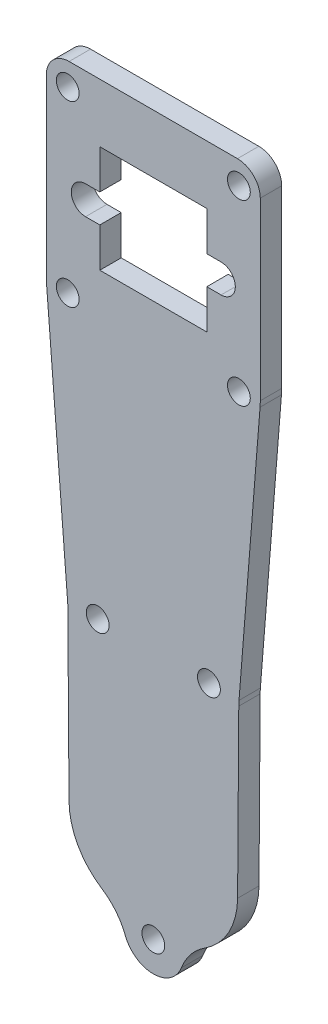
ISO-10303-21;
HEADER;
FILE_DESCRIPTION(('STEP AP214'),'2;1');
FILE_NAME('part.step','',(''),(''),'','','');
FILE_SCHEMA(('AUTOMOTIVE_DESIGN { 1 0 10303 214 1 1 1 1 }'));
ENDSEC;
DATA;
#1=APPLICATION_CONTEXT('core data for automotive mechanical design processes');
#2=APPLICATION_PROTOCOL_DEFINITION('international standard','automotive_design',2000,#1);
#3=PRODUCT_CONTEXT('',#1,'mechanical');
#4=PRODUCT('Part','Part','',(#3));
#5=PRODUCT_RELATED_PRODUCT_CATEGORY('part','',(#4));
#6=PRODUCT_DEFINITION_FORMATION('','',#4);
#7=PRODUCT_DEFINITION_CONTEXT('part definition',#1,'design');
#8=PRODUCT_DEFINITION('design','',#6,#7);
#9=PRODUCT_DEFINITION_SHAPE('','',#8);
#10=(LENGTH_UNIT() NAMED_UNIT(*) SI_UNIT(.MILLI.,.METRE.));
#11=(NAMED_UNIT(*) PLANE_ANGLE_UNIT() SI_UNIT($,.RADIAN.));
#12=(NAMED_UNIT(*) SI_UNIT($,.STERADIAN.) SOLID_ANGLE_UNIT());
#13=UNCERTAINTY_MEASURE_WITH_UNIT(LENGTH_MEASURE(1.E-05),#10,'distance_accuracy_value','');
#14=(GEOMETRIC_REPRESENTATION_CONTEXT(3) GLOBAL_UNCERTAINTY_ASSIGNED_CONTEXT((#13)) GLOBAL_UNIT_ASSIGNED_CONTEXT((#10,
#11,#12)) REPRESENTATION_CONTEXT('',''));
#15=CARTESIAN_POINT('',(0.,0.,0.));
#16=DIRECTION('',(0.,0.,1.));
#17=DIRECTION('',(1.,0.,0.));
#18=AXIS2_PLACEMENT_3D('',#15,#16,#17);
#19=CARTESIAN_POINT('',(9.49999999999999,50.,3.));
#20=DIRECTION('',(0.,0.,-1.));
#21=DIRECTION('',(-1.,0.,0.));
#22=AXIS2_PLACEMENT_3D('',#19,#20,#21);
#23=CYLINDRICAL_SURFACE('',#22,2.);
#24=DIRECTION('',(0.,0.,-1.));
#25=VECTOR('',#24,1.);
#26=CARTESIAN_POINT('',(9.49999999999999,48.,3.));
#27=LINE('',#26,#25);
#28=CARTESIAN_POINT('',(9.49999999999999,48.,3.));
#29=VERTEX_POINT('',#28);
#30=CARTESIAN_POINT('',(9.49999999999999,48.,0.));
#31=VERTEX_POINT('',#30);
#32=EDGE_CURVE('E614',#29,#31,#27,.T.);
#33=ORIENTED_EDGE('',*,*,#32,.F.);
#34=CARTESIAN_POINT('',(9.49999999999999,50.,3.));
#35=DIRECTION('',(0.,0.,1.));
#36=DIRECTION('',(1.,0.,0.));
#37=AXIS2_PLACEMENT_3D('',#34,#35,#36);
#38=CIRCLE('',#37,2.);
#39=CARTESIAN_POINT('',(9.5,52.,3.));
#40=VERTEX_POINT('',#39);
#41=EDGE_CURVE('E62',#29,#40,#38,.T.);
#42=ORIENTED_EDGE('',*,*,#41,.T.);
#43=DIRECTION('',(0.,0.,1.));
#44=VECTOR('',#43,1.);
#45=CARTESIAN_POINT('',(9.49999999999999,52.,3.));
#46=LINE('',#45,#44);
#47=CARTESIAN_POINT('',(9.5,52.,0.));
#48=VERTEX_POINT('',#47);
#49=EDGE_CURVE('E617',#48,#40,#46,.T.);
#50=ORIENTED_EDGE('',*,*,#49,.F.);
#51=CARTESIAN_POINT('',(9.49999999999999,50.,0.));
#52=DIRECTION('',(0.,0.,1.));
#53=DIRECTION('',(1.,0.,0.));
#54=AXIS2_PLACEMENT_3D('',#51,#52,#53);
#55=CIRCLE('',#54,2.);
#56=EDGE_CURVE('E11',#48,#31,#55,.F.);
#57=ORIENTED_EDGE('',*,*,#56,.T.);
#58=EDGE_LOOP('',(#33,#42,#50,#57));
#59=FACE_BOUND('',#58,.T.);
#60=ADVANCED_FACE('F53',(#59),#23,.F.);
#61=CARTESIAN_POINT('',(-9.5,50.,0.));
#62=DIRECTION('',(0.,0.,-1.));
#63=DIRECTION('',(-1.,0.,0.));
#64=AXIS2_PLACEMENT_3D('',#61,#62,#63);
#65=CYLINDRICAL_SURFACE('',#64,2.);
#66=DIRECTION('',(0.,0.,-1.));
#67=VECTOR('',#66,1.);
#68=CARTESIAN_POINT('',(-9.5,48.,3.));
#69=LINE('',#68,#67);
#70=CARTESIAN_POINT('',(-9.5,48.,0.));
#71=VERTEX_POINT('',#70);
#72=CARTESIAN_POINT('',(-9.5,48.,3.));
#73=VERTEX_POINT('',#72);
#74=EDGE_CURVE('E600',#71,#73,#69,.F.);
#75=ORIENTED_EDGE('',*,*,#74,.F.);
#76=CARTESIAN_POINT('',(-9.5,50.,0.));
#77=DIRECTION('',(0.,0.,1.));
#78=DIRECTION('',(1.,0.,0.));
#79=AXIS2_PLACEMENT_3D('',#76,#77,#78);
#80=CIRCLE('',#79,2.);
#81=CARTESIAN_POINT('',(-9.5,52.,0.));
#82=VERTEX_POINT('',#81);
#83=EDGE_CURVE('E608',#71,#82,#80,.F.);
#84=ORIENTED_EDGE('',*,*,#83,.T.);
#85=DIRECTION('',(0.,0.,1.));
#86=VECTOR('',#85,1.);
#87=CARTESIAN_POINT('',(-9.5,52.,0.));
#88=LINE('',#87,#86);
#89=CARTESIAN_POINT('',(-9.5,52.,3.));
#90=VERTEX_POINT('',#89);
#91=EDGE_CURVE('E604',#90,#82,#88,.F.);
#92=ORIENTED_EDGE('',*,*,#91,.F.);
#93=CARTESIAN_POINT('',(-9.5,50.,3.));
#94=DIRECTION('',(0.,0.,1.));
#95=DIRECTION('',(1.,0.,0.));
#96=AXIS2_PLACEMENT_3D('',#93,#94,#95);
#97=CIRCLE('',#96,2.);
#98=EDGE_CURVE('E611',#90,#73,#97,.T.);
#99=ORIENTED_EDGE('',*,*,#98,.T.);
#100=EDGE_LOOP('',(#75,#84,#92,#99));
#101=FACE_BOUND('',#100,.T.);
#102=ADVANCED_FACE('F757',(#101),#65,.F.);
#103=CARTESIAN_POINT('',(-11.77,-39.5169839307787,3.));
#104=DIRECTION('',(0.,0.,-1.));
#105=DIRECTION('',(-1.,0.,0.));
#106=AXIS2_PLACEMENT_3D('',#103,#104,#105);
#107=CYLINDRICAL_SURFACE('',#106,8.40698393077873);
#108=CARTESIAN_POINT('',(-11.77,-39.5169839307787,3.));
#109=DIRECTION('',(0.,0.,1.));
#110=DIRECTION('',(1.,0.,0.));
#111=AXIS2_PLACEMENT_3D('',#108,#109,#110);
#112=CIRCLE('',#111,8.40698393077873);
#113=CARTESIAN_POINT('',(-3.92115991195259,-36.5048272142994,3.));
#114=VERTEX_POINT('',#113);
#115=CARTESIAN_POINT('',(-7.22537581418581,-32.4442355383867,3.));
#116=VERTEX_POINT('',#115);
#117=EDGE_CURVE('E320',#114,#116,#112,.T.);
#118=ORIENTED_EDGE('',*,*,#117,.T.);
#119=DIRECTION('',(0.,0.,-1.));
#120=VECTOR('',#119,1.);
#121=CARTESIAN_POINT('',(-7.22537581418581,-32.4442355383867,3.));
#122=LINE('',#121,#120);
#123=CARTESIAN_POINT('',(-7.22537581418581,-32.4442355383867,0.));
#124=VERTEX_POINT('',#123);
#125=EDGE_CURVE('E584',#116,#124,#122,.T.);
#126=ORIENTED_EDGE('',*,*,#125,.T.);
#127=CARTESIAN_POINT('',(-11.77,-39.5169839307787,0.));
#128=DIRECTION('',(0.,0.,1.));
#129=DIRECTION('',(1.,0.,0.));
#130=AXIS2_PLACEMENT_3D('',#127,#128,#129);
#131=CIRCLE('',#130,8.40698393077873);
#132=CARTESIAN_POINT('',(-3.92115991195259,-36.5048272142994,0.));
#133=VERTEX_POINT('',#132);
#134=EDGE_CURVE('E425',#133,#124,#131,.T.);
#135=ORIENTED_EDGE('',*,*,#134,.F.);
#136=DIRECTION('',(0.,0.,-1.));
#137=VECTOR('',#136,1.);
#138=CARTESIAN_POINT('',(-3.92115991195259,-36.5048272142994,3.));
#139=LINE('',#138,#137);
#140=EDGE_CURVE('E499',#114,#133,#139,.T.);
#141=ORIENTED_EDGE('',*,*,#140,.F.);
#142=EDGE_LOOP('',(#118,#126,#135,#141));
#143=FACE_BOUND('',#142,.T.);
#144=ADVANCED_FACE('F781',(#143),#107,.F.);
#145=CARTESIAN_POINT('',(0.,-35.,3.));
#146=DIRECTION('',(0.,0.,-1.));
#147=DIRECTION('',(-1.,0.,0.));
#148=AXIS2_PLACEMENT_3D('',#145,#146,#147);
#149=CYLINDRICAL_SURFACE('',#148,4.2);
#150=CARTESIAN_POINT('',(0.,-35.,0.));
#151=DIRECTION('',(0.,0.,1.));
#152=DIRECTION('',(1.,0.,0.));
#153=AXIS2_PLACEMENT_3D('',#150,#151,#152);
#154=CIRCLE('',#153,4.2);
#155=CARTESIAN_POINT('',(3.92115991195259,-36.5048272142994,0.));
#156=VERTEX_POINT('',#155);
#157=EDGE_CURVE('E429',#133,#156,#154,.T.);
#158=ORIENTED_EDGE('',*,*,#157,.T.);
#159=DIRECTION('',(0.,0.,-1.));
#160=VECTOR('',#159,1.);
#161=CARTESIAN_POINT('',(3.92115991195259,-36.5048272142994,3.));
#162=LINE('',#161,#160);
#163=CARTESIAN_POINT('',(3.92115991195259,-36.5048272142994,3.));
#164=VERTEX_POINT('',#163);
#165=EDGE_CURVE('E495',#164,#156,#162,.T.);
#166=ORIENTED_EDGE('',*,*,#165,.F.);
#167=CARTESIAN_POINT('',(0.,-35.,3.));
#168=DIRECTION('',(0.,0.,1.));
#169=DIRECTION('',(1.,0.,0.));
#170=AXIS2_PLACEMENT_3D('',#167,#168,#169);
#171=CIRCLE('',#170,4.2);
#172=EDGE_CURVE('E324',#114,#164,#171,.T.);
#173=ORIENTED_EDGE('',*,*,#172,.F.);
#174=ORIENTED_EDGE('',*,*,#140,.T.);
#175=EDGE_LOOP('',(#158,#166,#173,#174));
#176=FACE_BOUND('',#175,.T.);
#177=ADVANCED_FACE('F784',(#176),#149,.T.);
#178=CARTESIAN_POINT('',(11.77,-39.5169839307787,3.));
#179=DIRECTION('',(0.,0.,-1.));
#180=DIRECTION('',(-1.,0.,0.));
#181=AXIS2_PLACEMENT_3D('',#178,#179,#180);
#182=CYLINDRICAL_SURFACE('',#181,8.40698393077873);
#183=CARTESIAN_POINT('',(11.77,-39.5169839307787,0.));
#184=DIRECTION('',(0.,0.,1.));
#185=DIRECTION('',(1.,0.,0.));
#186=AXIS2_PLACEMENT_3D('',#183,#184,#185);
#187=CIRCLE('',#186,8.40698393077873);
#188=CARTESIAN_POINT('',(7.22537581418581,-32.4442355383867,0.));
#189=VERTEX_POINT('',#188);
#190=EDGE_CURVE('E433',#156,#189,#187,.F.);
#191=ORIENTED_EDGE('',*,*,#190,.T.);
#192=DIRECTION('',(0.,0.,-1.));
#193=VECTOR('',#192,1.);
#194=CARTESIAN_POINT('',(7.22537581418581,-32.4442355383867,3.));
#195=LINE('',#194,#193);
#196=CARTESIAN_POINT('',(7.22537581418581,-32.4442355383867,3.));
#197=VERTEX_POINT('',#196);
#198=EDGE_CURVE('E581',#189,#197,#195,.F.);
#199=ORIENTED_EDGE('',*,*,#198,.T.);
#200=CARTESIAN_POINT('',(11.77,-39.5169839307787,3.));
#201=DIRECTION('',(0.,0.,1.));
#202=DIRECTION('',(1.,0.,0.));
#203=AXIS2_PLACEMENT_3D('',#200,#201,#202);
#204=CIRCLE('',#203,8.40698393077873);
#205=EDGE_CURVE('E328',#164,#197,#204,.F.);
#206=ORIENTED_EDGE('',*,*,#205,.F.);
#207=ORIENTED_EDGE('',*,*,#165,.T.);
#208=EDGE_LOOP('',(#191,#199,#206,#207));
#209=FACE_BOUND('',#208,.T.);
#210=ADVANCED_FACE('F931',(#209),#182,.F.);
#211=CARTESIAN_POINT('',(11.9884956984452,-0.0844282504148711,3.));
#212=DIRECTION('',(0.999975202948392,-0.00704226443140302,0.));
#213=DIRECTION('',(0.00704226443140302,0.999975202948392,0.));
#214=AXIS2_PLACEMENT_3D('',#211,#212,#213);
#215=PLANE('',#214);
#216=DIRECTION('',(-0.00704226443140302,-0.999975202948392,0.));
#217=VECTOR('',#216,1.);
#218=CARTESIAN_POINT('',(11.9884956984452,-0.0844282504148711,0.));
#219=LINE('',#218,#217);
#220=CARTESIAN_POINT('',(11.9841902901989,-0.695780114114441,0.));
#221=VERTEX_POINT('',#220);
#222=CARTESIAN_POINT('',(11.8193554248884,-24.1017143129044,0.));
#223=VERTEX_POINT('',#222);
#224=EDGE_CURVE('E437',#221,#223,#219,.T.);
#225=ORIENTED_EDGE('',*,*,#224,.F.);
#226=DIRECTION('',(0.,0.,-1.));
#227=VECTOR('',#226,1.);
#228=CARTESIAN_POINT('',(11.9841902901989,-0.695780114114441,3.));
#229=LINE('',#228,#227);
#230=CARTESIAN_POINT('',(11.9841902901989,-0.695780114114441,3.));
#231=VERTEX_POINT('',#230);
#232=EDGE_CURVE('E574',#221,#231,#229,.F.);
#233=ORIENTED_EDGE('',*,*,#232,.T.);
#234=DIRECTION('',(-0.00704226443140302,-0.999975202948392,0.));
#235=VECTOR('',#234,1.);
#236=CARTESIAN_POINT('',(11.9884956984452,-0.0844282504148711,3.));
#237=LINE('',#236,#235);
#238=CARTESIAN_POINT('',(11.8193554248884,-24.1017143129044,3.));
#239=VERTEX_POINT('',#238);
#240=EDGE_CURVE('E332',#231,#239,#237,.T.);
#241=ORIENTED_EDGE('',*,*,#240,.T.);
#242=DIRECTION('',(0.,0.,1.));
#243=VECTOR('',#242,1.);
#244=CARTESIAN_POINT('',(11.8193554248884,-24.1017143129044,0.));
#245=LINE('',#244,#243);
#246=EDGE_CURVE('E570',#239,#223,#245,.F.);
#247=ORIENTED_EDGE('',*,*,#246,.T.);
#248=EDGE_LOOP('',(#225,#233,#241,#247));
#249=FACE_BOUND('',#248,.T.);
#250=ADVANCED_FACE('F936',(#249),#215,.T.);
#251=CARTESIAN_POINT('',(11.9375754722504,-0.950772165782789,3.));
#252=DIRECTION('',(-0.99684332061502,0.0793939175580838,0.));
#253=DIRECTION('',(-0.0793939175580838,-0.99684332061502,0.));
#254=AXIS2_PLACEMENT_3D('',#251,#252,#253);
#255=PLANE('',#254);
#256=DIRECTION('',(0.0793939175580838,0.99684332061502,0.));
#257=VECTOR('',#256,1.);
#258=CARTESIAN_POINT('',(11.9375754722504,-0.950772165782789,3.));
#259=LINE('',#258,#257);
#260=CARTESIAN_POINT('',(12.0155091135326,0.0277364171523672,3.));
#261=VERTEX_POINT('',#260);
#262=CARTESIAN_POINT('',(14.9684332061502,37.1036579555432,3.));
#263=VERTEX_POINT('',#262);
#264=EDGE_CURVE('E336',#261,#263,#259,.T.);
#265=ORIENTED_EDGE('',*,*,#264,.F.);
#266=DIRECTION('',(0.,0.,-1.));
#267=VECTOR('',#266,1.);
#268=CARTESIAN_POINT('',(12.0155091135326,0.027736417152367,3.));
#269=LINE('',#268,#267);
#270=CARTESIAN_POINT('',(12.0155091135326,0.0277364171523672,0.));
#271=VERTEX_POINT('',#270);
#272=EDGE_CURVE('E566',#261,#271,#269,.T.);
#273=ORIENTED_EDGE('',*,*,#272,.T.);
#274=DIRECTION('',(0.0793939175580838,0.99684332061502,0.));
#275=VECTOR('',#274,1.);
#276=CARTESIAN_POINT('',(11.9375754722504,-0.950772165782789,0.));
#277=LINE('',#276,#275);
#278=CARTESIAN_POINT('',(14.9684332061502,37.1036579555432,0.));
#279=VERTEX_POINT('',#278);
#280=EDGE_CURVE('E441',#271,#279,#277,.T.);
#281=ORIENTED_EDGE('',*,*,#280,.T.);
#282=DIRECTION('',(0.,0.,-1.));
#283=VECTOR('',#282,1.);
#284=CARTESIAN_POINT('',(14.9684332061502,37.1036579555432,3.));
#285=LINE('',#284,#283);
#286=EDGE_CURVE('E564',#279,#263,#285,.F.);
#287=ORIENTED_EDGE('',*,*,#286,.T.);
#288=EDGE_LOOP('',(#265,#273,#281,#287));
#289=FACE_BOUND('',#288,.T.);
#290=ADVANCED_FACE('F946',(#289),#255,.F.);
#291=CARTESIAN_POINT('',(15.,0.,3.));
#292=DIRECTION('',(1.,0.,0.));
#293=DIRECTION('',(0.,1.,0.));
#294=AXIS2_PLACEMENT_3D('',#291,#292,#293);
#295=PLANE('',#294);
#296=DIRECTION('',(0.,-1.,0.));
#297=VECTOR('',#296,1.);
#298=CARTESIAN_POINT('',(15.,0.,3.));
#299=LINE('',#298,#297);
#300=CARTESIAN_POINT('',(15.,62.5,3.));
#301=VERTEX_POINT('',#300);
#302=CARTESIAN_POINT('',(15.,37.8975971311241,3.));
#303=VERTEX_POINT('',#302);
#304=EDGE_CURVE('E340',#301,#303,#299,.T.);
#305=ORIENTED_EDGE('',*,*,#304,.T.);
#306=DIRECTION('',(0.,0.,-1.));
#307=VECTOR('',#306,1.);
#308=CARTESIAN_POINT('',(15.,37.8975971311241,0.));
#309=LINE('',#308,#307);
#310=CARTESIAN_POINT('',(15.,37.8975971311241,0.));
#311=VERTEX_POINT('',#310);
#312=EDGE_CURVE('E577',#303,#311,#309,.T.);
#313=ORIENTED_EDGE('',*,*,#312,.T.);
#314=DIRECTION('',(0.,-1.,0.));
#315=VECTOR('',#314,1.);
#316=CARTESIAN_POINT('',(15.,0.,0.));
#317=LINE('',#316,#315);
#318=CARTESIAN_POINT('',(15.,62.5,0.));
#319=VERTEX_POINT('',#318);
#320=EDGE_CURVE('E445',#319,#311,#317,.T.);
#321=ORIENTED_EDGE('',*,*,#320,.F.);
#322=DIRECTION('',(0.,0.,-1.));
#323=VECTOR('',#322,1.);
#324=CARTESIAN_POINT('',(15.,62.5,3.));
#325=LINE('',#324,#323);
#326=EDGE_CURVE('E492',#301,#319,#325,.T.);
#327=ORIENTED_EDGE('',*,*,#326,.F.);
#328=EDGE_LOOP('',(#305,#313,#321,#327));
#329=FACE_BOUND('',#328,.T.);
#330=ADVANCED_FACE('F956',(#329),#295,.T.);
#331=CARTESIAN_POINT('',(11.8,62.5,3.));
#332=DIRECTION('',(0.,0.,-1.));
#333=DIRECTION('',(-1.,0.,0.));
#334=AXIS2_PLACEMENT_3D('',#331,#332,#333);
#335=CYLINDRICAL_SURFACE('',#334,3.2);
#336=CARTESIAN_POINT('',(11.8,62.5,0.));
#337=DIRECTION('',(0.,0.,1.));
#338=DIRECTION('',(1.,0.,0.));
#339=AXIS2_PLACEMENT_3D('',#336,#337,#338);
#340=CIRCLE('',#339,3.2);
#341=CARTESIAN_POINT('',(11.8,65.7,0.));
#342=VERTEX_POINT('',#341);
#343=EDGE_CURVE('E449',#342,#319,#340,.F.);
#344=ORIENTED_EDGE('',*,*,#343,.F.);
#345=DIRECTION('',(0.,0.,-1.));
#346=VECTOR('',#345,1.);
#347=CARTESIAN_POINT('',(11.8,65.7,3.));
#348=LINE('',#347,#346);
#349=CARTESIAN_POINT('',(11.8,65.7,3.));
#350=VERTEX_POINT('',#349);
#351=EDGE_CURVE('E489',#350,#342,#348,.T.);
#352=ORIENTED_EDGE('',*,*,#351,.F.);
#353=CARTESIAN_POINT('',(11.8,62.5,3.));
#354=DIRECTION('',(0.,0.,1.));
#355=DIRECTION('',(1.,0.,0.));
#356=AXIS2_PLACEMENT_3D('',#353,#354,#355);
#357=CIRCLE('',#356,3.2);
#358=EDGE_CURVE('E344',#350,#301,#357,.F.);
#359=ORIENTED_EDGE('',*,*,#358,.T.);
#360=ORIENTED_EDGE('',*,*,#326,.T.);
#361=EDGE_LOOP('',(#344,#352,#359,#360));
#362=FACE_BOUND('',#361,.T.);
#363=ADVANCED_FACE('F966',(#362),#335,.T.);
#364=CARTESIAN_POINT('',(0.,65.7,3.));
#365=DIRECTION('',(0.,1.,0.));
#366=DIRECTION('',(0.,0.,1.));
#367=AXIS2_PLACEMENT_3D('',#364,#365,#366);
#368=PLANE('',#367);
#369=DIRECTION('',(1.,0.,0.));
#370=VECTOR('',#369,1.);
#371=CARTESIAN_POINT('',(0.,65.7,0.));
#372=LINE('',#371,#370);
#373=CARTESIAN_POINT('',(-11.8,65.7,0.));
#374=VERTEX_POINT('',#373);
#375=EDGE_CURVE('E453',#374,#342,#372,.T.);
#376=ORIENTED_EDGE('',*,*,#375,.F.);
#377=DIRECTION('',(0.,0.,-1.));
#378=VECTOR('',#377,1.);
#379=CARTESIAN_POINT('',(-11.8,65.7,3.));
#380=LINE('',#379,#378);
#381=CARTESIAN_POINT('',(-11.8,65.7,3.));
#382=VERTEX_POINT('',#381);
#383=EDGE_CURVE('E486',#382,#374,#380,.T.);
#384=ORIENTED_EDGE('',*,*,#383,.F.);
#385=DIRECTION('',(1.,0.,0.));
#386=VECTOR('',#385,1.);
#387=CARTESIAN_POINT('',(0.,65.7,3.));
#388=LINE('',#387,#386);
#389=EDGE_CURVE('E348',#382,#350,#388,.T.);
#390=ORIENTED_EDGE('',*,*,#389,.T.);
#391=ORIENTED_EDGE('',*,*,#351,.T.);
#392=EDGE_LOOP('',(#376,#384,#390,#391));
#393=FACE_BOUND('',#392,.T.);
#394=ADVANCED_FACE('F1141',(#393),#368,.T.);
#395=CARTESIAN_POINT('',(-11.8,62.5,3.));
#396=DIRECTION('',(0.,0.,-1.));
#397=DIRECTION('',(-1.,0.,0.));
#398=AXIS2_PLACEMENT_3D('',#395,#396,#397);
#399=CYLINDRICAL_SURFACE('',#398,3.2);
#400=CARTESIAN_POINT('',(-11.8,62.5,0.));
#401=DIRECTION('',(0.,0.,1.));
#402=DIRECTION('',(1.,0.,0.));
#403=AXIS2_PLACEMENT_3D('',#400,#401,#402);
#404=CIRCLE('',#403,3.2);
#405=CARTESIAN_POINT('',(-15.,62.5,0.));
#406=VERTEX_POINT('',#405);
#407=EDGE_CURVE('E457',#406,#374,#404,.F.);
#408=ORIENTED_EDGE('',*,*,#407,.F.);
#409=DIRECTION('',(0.,0.,-1.));
#410=VECTOR('',#409,1.);
#411=CARTESIAN_POINT('',(-15.,62.5,3.));
#412=LINE('',#411,#410);
#413=CARTESIAN_POINT('',(-15.,62.5,3.));
#414=VERTEX_POINT('',#413);
#415=EDGE_CURVE('E260',#414,#406,#412,.T.);
#416=ORIENTED_EDGE('',*,*,#415,.F.);
#417=CARTESIAN_POINT('',(-11.8,62.5,3.));
#418=DIRECTION('',(0.,0.,1.));
#419=DIRECTION('',(1.,0.,0.));
#420=AXIS2_PLACEMENT_3D('',#417,#418,#419);
#421=CIRCLE('',#420,3.2);
#422=EDGE_CURVE('E352',#414,#382,#421,.F.);
#423=ORIENTED_EDGE('',*,*,#422,.T.);
#424=ORIENTED_EDGE('',*,*,#383,.T.);
#425=EDGE_LOOP('',(#408,#416,#423,#424));
#426=FACE_BOUND('',#425,.T.);
#427=ADVANCED_FACE('F979',(#426),#399,.T.);
#428=CARTESIAN_POINT('',(-15.,0.,3.));
#429=DIRECTION('',(-1.,0.,0.));
#430=DIRECTION('',(0.,-1.,0.));
#431=AXIS2_PLACEMENT_3D('',#428,#429,#430);
#432=PLANE('',#431);
#433=DIRECTION('',(0.,1.,0.));
#434=VECTOR('',#433,1.);
#435=CARTESIAN_POINT('',(-15.,0.,0.));
#436=LINE('',#435,#434);
#437=CARTESIAN_POINT('',(-15.,37.897597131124,0.));
#438=VERTEX_POINT('',#437);
#439=EDGE_CURVE('E461',#438,#406,#436,.T.);
#440=ORIENTED_EDGE('',*,*,#439,.F.);
#441=DIRECTION('',(0.,0.,-1.));
#442=VECTOR('',#441,1.);
#443=CARTESIAN_POINT('',(-15.,37.897597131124,3.));
#444=LINE('',#443,#442);
#445=CARTESIAN_POINT('',(-15.,37.897597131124,3.));
#446=VERTEX_POINT('',#445);
#447=EDGE_CURVE('E549',#438,#446,#444,.F.);
#448=ORIENTED_EDGE('',*,*,#447,.T.);
#449=DIRECTION('',(0.,1.,0.));
#450=VECTOR('',#449,1.);
#451=CARTESIAN_POINT('',(-15.,0.,3.));
#452=LINE('',#451,#450);
#453=EDGE_CURVE('E356',#446,#414,#452,.T.);
#454=ORIENTED_EDGE('',*,*,#453,.T.);
#455=ORIENTED_EDGE('',*,*,#415,.T.);
#456=EDGE_LOOP('',(#440,#448,#454,#455));
#457=FACE_BOUND('',#456,.T.);
#458=ADVANCED_FACE('F974',(#457),#432,.T.);
#459=CARTESIAN_POINT('',(-11.9375754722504,-0.950772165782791,3.));
#460=DIRECTION('',(-0.99684332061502,-0.079393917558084,0.));
#461=DIRECTION('',(0.079393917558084,-0.99684332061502,0.));
#462=AXIS2_PLACEMENT_3D('',#459,#460,#461);
#463=PLANE('',#462);
#464=DIRECTION('',(-0.079393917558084,0.99684332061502,0.));
#465=VECTOR('',#464,1.);
#466=CARTESIAN_POINT('',(-11.9375754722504,-0.950772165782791,0.));
#467=LINE('',#466,#465);
#468=CARTESIAN_POINT('',(-12.0155091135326,0.0277364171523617,0.));
#469=VERTEX_POINT('',#468);
#470=CARTESIAN_POINT('',(-14.9684332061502,37.1036579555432,0.));
#471=VERTEX_POINT('',#470);
#472=EDGE_CURVE('E464',#469,#471,#467,.T.);
#473=ORIENTED_EDGE('',*,*,#472,.F.);
#474=DIRECTION('',(0.,0.,-1.));
#475=VECTOR('',#474,1.);
#476=CARTESIAN_POINT('',(-12.0155091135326,0.0277364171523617,3.));
#477=LINE('',#476,#475);
#478=CARTESIAN_POINT('',(-12.0155091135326,0.0277364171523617,3.));
#479=VERTEX_POINT('',#478);
#480=EDGE_CURVE('E534',#469,#479,#477,.F.);
#481=ORIENTED_EDGE('',*,*,#480,.T.);
#482=DIRECTION('',(-0.079393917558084,0.99684332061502,0.));
#483=VECTOR('',#482,1.);
#484=CARTESIAN_POINT('',(-11.9375754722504,-0.950772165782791,3.));
#485=LINE('',#484,#483);
#486=CARTESIAN_POINT('',(-14.9684332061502,37.1036579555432,3.));
#487=VERTEX_POINT('',#486);
#488=EDGE_CURVE('E359',#479,#487,#485,.T.);
#489=ORIENTED_EDGE('',*,*,#488,.T.);
#490=DIRECTION('',(0.,0.,-1.));
#491=VECTOR('',#490,1.);
#492=CARTESIAN_POINT('',(-14.9684332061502,37.1036579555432,3.));
#493=LINE('',#492,#491);
#494=EDGE_CURVE('E530',#487,#471,#493,.T.);
#495=ORIENTED_EDGE('',*,*,#494,.T.);
#496=EDGE_LOOP('',(#473,#481,#489,#495));
#497=FACE_BOUND('',#496,.T.);
#498=ADVANCED_FACE('F817',(#497),#463,.T.);
#499=CARTESIAN_POINT('',(0.,52.,3.));
#500=DIRECTION('',(0.,1.,0.));
#501=DIRECTION('',(0.,0.,1.));
#502=AXIS2_PLACEMENT_3D('',#499,#500,#501);
#503=PLANE('',#502);
#504=DIRECTION('',(1.,0.,0.));
#505=VECTOR('',#504,1.);
#506=CARTESIAN_POINT('',(0.,52.,0.));
#507=LINE('',#506,#505);
#508=CARTESIAN_POINT('',(7.5,52.,0.));
#509=VERTEX_POINT('',#508);
#510=EDGE_CURVE('E380',#509,#48,#507,.T.);
#511=ORIENTED_EDGE('',*,*,#510,.T.);
#512=ORIENTED_EDGE('',*,*,#49,.T.);
#513=DIRECTION('',(1.,0.,0.));
#514=VECTOR('',#513,1.);
#515=CARTESIAN_POINT('',(0.,52.,3.));
#516=LINE('',#515,#514);
#517=CARTESIAN_POINT('',(7.5,52.,3.));
#518=VERTEX_POINT('',#517);
#519=EDGE_CURVE('E277',#518,#40,#516,.T.);
#520=ORIENTED_EDGE('',*,*,#519,.F.);
#521=DIRECTION('',(0.,0.,-1.));
#522=VECTOR('',#521,1.);
#523=CARTESIAN_POINT('',(7.5,52.,3.));
#524=LINE('',#523,#522);
#525=EDGE_CURVE('E379',#518,#509,#524,.T.);
#526=ORIENTED_EDGE('',*,*,#525,.T.);
#527=EDGE_LOOP('',(#511,#512,#520,#526));
#528=FACE_BOUND('',#527,.T.);
#529=ADVANCED_FACE('F739',(#528),#503,.F.);
#530=CARTESIAN_POINT('',(0.,48.,3.));
#531=DIRECTION('',(0.,1.,0.));
#532=DIRECTION('',(0.,0.,1.));
#533=AXIS2_PLACEMENT_3D('',#530,#531,#532);
#534=PLANE('',#533);
#535=DIRECTION('',(1.,0.,0.));
#536=VECTOR('',#535,1.);
#537=CARTESIAN_POINT('',(0.,48.,3.));
#538=LINE('',#537,#536);
#539=CARTESIAN_POINT('',(7.5,48.,3.));
#540=VERTEX_POINT('',#539);
#541=EDGE_CURVE('E254',#540,#29,#538,.T.);
#542=ORIENTED_EDGE('',*,*,#541,.T.);
#543=ORIENTED_EDGE('',*,*,#32,.T.);
#544=DIRECTION('',(1.,0.,0.));
#545=VECTOR('',#544,1.);
#546=CARTESIAN_POINT('',(0.,48.,0.));
#547=LINE('',#546,#545);
#548=CARTESIAN_POINT('',(7.5,48.,0.));
#549=VERTEX_POINT('',#548);
#550=EDGE_CURVE('E255',#549,#31,#547,.T.);
#551=ORIENTED_EDGE('',*,*,#550,.F.);
#552=DIRECTION('',(0.,0.,-1.));
#553=VECTOR('',#552,1.);
#554=CARTESIAN_POINT('',(7.5,48.,3.));
#555=LINE('',#554,#553);
#556=EDGE_CURVE('E249',#540,#549,#555,.T.);
#557=ORIENTED_EDGE('',*,*,#556,.F.);
#558=EDGE_LOOP('',(#542,#543,#551,#557));
#559=FACE_BOUND('',#558,.T.);
#560=ADVANCED_FACE('F251',(#559),#534,.T.);
#561=CARTESIAN_POINT('',(7.50000000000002,0.,3.));
#562=DIRECTION('',(1.,0.,0.));
#563=DIRECTION('',(0.,1.,0.));
#564=AXIS2_PLACEMENT_3D('',#561,#562,#563);
#565=PLANE('',#564);
#566=DIRECTION('',(0.,-1.,0.));
#567=VECTOR('',#566,1.);
#568=CARTESIAN_POINT('',(7.50000000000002,0.,0.));
#569=LINE('',#568,#567);
#570=CARTESIAN_POINT('',(7.5,42.5,0.));
#571=VERTEX_POINT('',#570);
#572=EDGE_CURVE('E385',#549,#571,#569,.T.);
#573=ORIENTED_EDGE('',*,*,#572,.T.);
#574=DIRECTION('',(0.,0.,-1.));
#575=VECTOR('',#574,1.);
#576=CARTESIAN_POINT('',(7.5,42.5,3.));
#577=LINE('',#576,#575);
#578=CARTESIAN_POINT('',(7.5,42.5,3.));
#579=VERTEX_POINT('',#578);
#580=EDGE_CURVE('E261',#579,#571,#577,.T.);
#581=ORIENTED_EDGE('',*,*,#580,.F.);
#582=DIRECTION('',(0.,-1.,0.));
#583=VECTOR('',#582,1.);
#584=CARTESIAN_POINT('',(7.50000000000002,0.,3.));
#585=LINE('',#584,#583);
#586=EDGE_CURVE('E264',#540,#579,#585,.T.);
#587=ORIENTED_EDGE('',*,*,#586,.F.);
#588=ORIENTED_EDGE('',*,*,#556,.T.);
#589=EDGE_LOOP('',(#573,#581,#587,#588));
#590=FACE_BOUND('',#589,.T.);
#591=ADVANCED_FACE('F265',(#590),#565,.F.);
#592=CARTESIAN_POINT('',(0.,42.5,3.));
#593=DIRECTION('',(0.,1.,0.));
#594=DIRECTION('',(0.,0.,1.));
#595=AXIS2_PLACEMENT_3D('',#592,#593,#594);
#596=PLANE('',#595);
#597=DIRECTION('',(1.,0.,0.));
#598=VECTOR('',#597,1.);
#599=CARTESIAN_POINT('',(0.,42.5,0.));
#600=LINE('',#599,#598);
#601=CARTESIAN_POINT('',(-7.5,42.5,0.));
#602=VERTEX_POINT('',#601);
#603=EDGE_CURVE('E388',#602,#571,#600,.T.);
#604=ORIENTED_EDGE('',*,*,#603,.F.);
#605=DIRECTION('',(0.,0.,-1.));
#606=VECTOR('',#605,1.);
#607=CARTESIAN_POINT('',(-7.5,42.5,3.));
#608=LINE('',#607,#606);
#609=CARTESIAN_POINT('',(-7.5,42.5,3.));
#610=VERTEX_POINT('',#609);
#611=EDGE_CURVE('E519',#610,#602,#608,.T.);
#612=ORIENTED_EDGE('',*,*,#611,.F.);
#613=DIRECTION('',(1.,0.,0.));
#614=VECTOR('',#613,1.);
#615=CARTESIAN_POINT('',(0.,42.5,3.));
#616=LINE('',#615,#614);
#617=EDGE_CURVE('E270',#610,#579,#616,.T.);
#618=ORIENTED_EDGE('',*,*,#617,.T.);
#619=ORIENTED_EDGE('',*,*,#580,.T.);
#620=EDGE_LOOP('',(#604,#612,#618,#619));
#621=FACE_BOUND('',#620,.T.);
#622=ADVANCED_FACE('F746',(#621),#596,.T.);
#623=CARTESIAN_POINT('',(-7.49999999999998,0.,3.));
#624=DIRECTION('',(1.,0.,0.));
#625=DIRECTION('',(0.,1.,0.));
#626=AXIS2_PLACEMENT_3D('',#623,#624,#625);
#627=PLANE('',#626);
#628=DIRECTION('',(0.,-1.,0.));
#629=VECTOR('',#628,1.);
#630=CARTESIAN_POINT('',(-7.49999999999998,0.,0.));
#631=LINE('',#630,#629);
#632=CARTESIAN_POINT('',(-7.5,48.,0.));
#633=VERTEX_POINT('',#632);
#634=EDGE_CURVE('E393',#633,#602,#631,.T.);
#635=ORIENTED_EDGE('',*,*,#634,.F.);
#636=DIRECTION('',(0.,0.,-1.));
#637=VECTOR('',#636,1.);
#638=CARTESIAN_POINT('',(-7.5,48.,3.));
#639=LINE('',#638,#637);
#640=CARTESIAN_POINT('',(-7.5,48.,3.));
#641=VERTEX_POINT('',#640);
#642=EDGE_CURVE('E516',#641,#633,#639,.T.);
#643=ORIENTED_EDGE('',*,*,#642,.F.);
#644=DIRECTION('',(0.,-1.,0.));
#645=VECTOR('',#644,1.);
#646=CARTESIAN_POINT('',(-7.49999999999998,0.,3.));
#647=LINE('',#646,#645);
#648=EDGE_CURVE('E288',#641,#610,#647,.T.);
#649=ORIENTED_EDGE('',*,*,#648,.T.);
#650=ORIENTED_EDGE('',*,*,#611,.T.);
#651=EDGE_LOOP('',(#635,#643,#649,#650));
#652=FACE_BOUND('',#651,.T.);
#653=ADVANCED_FACE('F749',(#652),#627,.T.);
#654=CARTESIAN_POINT('',(0.,48.,3.));
#655=DIRECTION('',(0.,-1.,0.));
#656=DIRECTION('',(0.,0.,-1.));
#657=AXIS2_PLACEMENT_3D('',#654,#655,#656);
#658=PLANE('',#657);
#659=DIRECTION('',(-1.,0.,0.));
#660=VECTOR('',#659,1.);
#661=CARTESIAN_POINT('',(0.,48.,0.));
#662=LINE('',#661,#660);
#663=EDGE_CURVE('E397',#633,#71,#662,.T.);
#664=ORIENTED_EDGE('',*,*,#663,.T.);
#665=ORIENTED_EDGE('',*,*,#74,.T.);
#666=DIRECTION('',(-1.,0.,0.));
#667=VECTOR('',#666,1.);
#668=CARTESIAN_POINT('',(0.,48.,3.));
#669=LINE('',#668,#667);
#670=EDGE_CURVE('E292',#641,#73,#669,.T.);
#671=ORIENTED_EDGE('',*,*,#670,.F.);
#672=ORIENTED_EDGE('',*,*,#642,.T.);
#673=EDGE_LOOP('',(#664,#665,#671,#672));
#674=FACE_BOUND('',#673,.T.);
#675=ADVANCED_FACE('F752',(#674),#658,.F.);
#676=CARTESIAN_POINT('',(0.,52.,3.));
#677=DIRECTION('',(0.,-1.,0.));
#678=DIRECTION('',(0.,0.,-1.));
#679=AXIS2_PLACEMENT_3D('',#676,#677,#678);
#680=PLANE('',#679);
#681=DIRECTION('',(-1.,0.,0.));
#682=VECTOR('',#681,1.);
#683=CARTESIAN_POINT('',(0.,52.,3.));
#684=LINE('',#683,#682);
#685=CARTESIAN_POINT('',(-7.5,52.,3.));
#686=VERTEX_POINT('',#685);
#687=EDGE_CURVE('E297',#686,#90,#684,.T.);
#688=ORIENTED_EDGE('',*,*,#687,.T.);
#689=ORIENTED_EDGE('',*,*,#91,.T.);
#690=DIRECTION('',(-1.,0.,0.));
#691=VECTOR('',#690,1.);
#692=CARTESIAN_POINT('',(0.,52.,0.));
#693=LINE('',#692,#691);
#694=CARTESIAN_POINT('',(-7.5,52.,0.));
#695=VERTEX_POINT('',#694);
#696=EDGE_CURVE('E402',#695,#82,#693,.T.);
#697=ORIENTED_EDGE('',*,*,#696,.F.);
#698=DIRECTION('',(0.,0.,-1.));
#699=VECTOR('',#698,1.);
#700=CARTESIAN_POINT('',(-7.5,52.,3.));
#701=LINE('',#700,#699);
#702=EDGE_CURVE('E513',#686,#695,#701,.T.);
#703=ORIENTED_EDGE('',*,*,#702,.F.);
#704=EDGE_LOOP('',(#688,#689,#697,#703));
#705=FACE_BOUND('',#704,.T.);
#706=ADVANCED_FACE('F760',(#705),#680,.T.);
#707=CARTESIAN_POINT('',(-7.50000000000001,57.5,0.));
#708=VERTEX_POINT('',#707);
#709=EDGE_CURVE('E398',#708,#695,#631,.T.);
#710=ORIENTED_EDGE('',*,*,#709,.F.);
#711=DIRECTION('',(0.,0.,-1.));
#712=VECTOR('',#711,1.);
#713=CARTESIAN_POINT('',(-7.50000000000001,57.5,3.));
#714=LINE('',#713,#712);
#715=CARTESIAN_POINT('',(-7.50000000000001,57.5,3.));
#716=VERTEX_POINT('',#715);
#717=EDGE_CURVE('E510',#716,#708,#714,.T.);
#718=ORIENTED_EDGE('',*,*,#717,.F.);
#719=EDGE_CURVE('E293',#716,#686,#647,.T.);
#720=ORIENTED_EDGE('',*,*,#719,.T.);
#721=ORIENTED_EDGE('',*,*,#702,.T.);
#722=EDGE_LOOP('',(#710,#718,#720,#721));
#723=FACE_BOUND('',#722,.T.);
#724=ADVANCED_FACE('F763',(#723),#627,.T.);
#725=CARTESIAN_POINT('',(0.,57.5,3.));
#726=DIRECTION('',(0.,1.,0.));
#727=DIRECTION('',(0.,0.,1.));
#728=AXIS2_PLACEMENT_3D('',#725,#726,#727);
#729=PLANE('',#728);
#730=DIRECTION('',(1.,0.,0.));
#731=VECTOR('',#730,1.);
#732=CARTESIAN_POINT('',(0.,57.5,0.));
#733=LINE('',#732,#731);
#734=CARTESIAN_POINT('',(7.49999999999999,57.5,0.));
#735=VERTEX_POINT('',#734);
#736=EDGE_CURVE('E406',#708,#735,#733,.T.);
#737=ORIENTED_EDGE('',*,*,#736,.T.);
#738=DIRECTION('',(0.,0.,-1.));
#739=VECTOR('',#738,1.);
#740=CARTESIAN_POINT('',(7.49999999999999,57.5,3.));
#741=LINE('',#740,#739);
#742=CARTESIAN_POINT('',(7.49999999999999,57.5,3.));
#743=VERTEX_POINT('',#742);
#744=EDGE_CURVE('E506',#743,#735,#741,.T.);
#745=ORIENTED_EDGE('',*,*,#744,.F.);
#746=DIRECTION('',(1.,0.,0.));
#747=VECTOR('',#746,1.);
#748=CARTESIAN_POINT('',(0.,57.5,3.));
#749=LINE('',#748,#747);
#750=EDGE_CURVE('E301',#716,#743,#749,.T.);
#751=ORIENTED_EDGE('',*,*,#750,.F.);
#752=ORIENTED_EDGE('',*,*,#717,.T.);
#753=EDGE_LOOP('',(#737,#745,#751,#752));
#754=FACE_BOUND('',#753,.T.);
#755=ADVANCED_FACE('F766',(#754),#729,.F.);
#756=CARTESIAN_POINT('',(7.8,0.,3.));
#757=DIRECTION('',(0.,0.,-1.));
#758=DIRECTION('',(-1.,0.,0.));
#759=AXIS2_PLACEMENT_3D('',#756,#757,#758);
#760=CYLINDRICAL_SURFACE('',#759,1.6);
#761=CARTESIAN_POINT('',(7.8,0.,3.));
#762=DIRECTION('',(0.,0.,1.));
#763=DIRECTION('',(1.,0.,0.));
#764=AXIS2_PLACEMENT_3D('',#761,#762,#763);
#765=CIRCLE('',#764,1.6);
#766=CARTESIAN_POINT('',(9.4,0.,3.));
#767=VERTEX_POINT('',#766);
#768=EDGE_CURVE('E371',#767,#767,#765,.T.);
#769=ORIENTED_EDGE('',*,*,#768,.T.);
#770=EDGE_LOOP('',(#769));
#771=FACE_BOUND('',#770,.T.);
#772=CARTESIAN_POINT('',(7.8,0.,0.));
#773=DIRECTION('',(0.,0.,1.));
#774=DIRECTION('',(1.,0.,0.));
#775=AXIS2_PLACEMENT_3D('',#772,#773,#774);
#776=CIRCLE('',#775,1.6);
#777=CARTESIAN_POINT('',(9.4,0.,0.));
#778=VERTEX_POINT('',#777);
#779=EDGE_CURVE('E476',#778,#778,#776,.T.);
#780=ORIENTED_EDGE('',*,*,#779,.F.);
#781=EDGE_LOOP('',(#780));
#782=FACE_BOUND('',#781,.T.);
#783=ADVANCED_FACE('F768',(#771,#782),#760,.F.);
#784=CARTESIAN_POINT('',(-7.8,0.,3.));
#785=DIRECTION('',(0.,0.,-1.));
#786=DIRECTION('',(-1.,0.,0.));
#787=AXIS2_PLACEMENT_3D('',#784,#785,#786);
#788=CYLINDRICAL_SURFACE('',#787,1.6);
#789=CARTESIAN_POINT('',(-7.8,0.,3.));
#790=DIRECTION('',(0.,0.,1.));
#791=DIRECTION('',(1.,0.,0.));
#792=AXIS2_PLACEMENT_3D('',#789,#790,#791);
#793=CIRCLE('',#792,1.6);
#794=CARTESIAN_POINT('',(-6.2,0.,3.));
#795=VERTEX_POINT('',#794);
#796=EDGE_CURVE('E367',#795,#795,#793,.T.);
#797=ORIENTED_EDGE('',*,*,#796,.T.);
#798=EDGE_LOOP('',(#797));
#799=FACE_BOUND('',#798,.T.);
#800=CARTESIAN_POINT('',(-7.8,0.,0.));
#801=DIRECTION('',(0.,0.,1.));
#802=DIRECTION('',(1.,0.,0.));
#803=AXIS2_PLACEMENT_3D('',#800,#801,#802);
#804=CIRCLE('',#803,1.6);
#805=CARTESIAN_POINT('',(-6.2,0.,0.));
#806=VERTEX_POINT('',#805);
#807=EDGE_CURVE('E472',#806,#806,#804,.T.);
#808=ORIENTED_EDGE('',*,*,#807,.F.);
#809=EDGE_LOOP('',(#808));
#810=FACE_BOUND('',#809,.T.);
#811=ADVANCED_FACE('F773',(#799,#810),#788,.F.);
#812=CARTESIAN_POINT('',(-11.9884956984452,-0.0844282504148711,3.));
#813=DIRECTION('',(0.999975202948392,0.00704226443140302,0.));
#814=DIRECTION('',(-0.00704226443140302,0.999975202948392,0.));
#815=AXIS2_PLACEMENT_3D('',#812,#813,#814);
#816=PLANE('',#815);
#817=DIRECTION('',(0.00704226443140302,-0.999975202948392,0.));
#818=VECTOR('',#817,1.);
#819=CARTESIAN_POINT('',(-11.9884956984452,-0.0844282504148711,3.));
#820=LINE('',#819,#818);
#821=CARTESIAN_POINT('',(-11.9841902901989,-0.695780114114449,3.));
#822=VERTEX_POINT('',#821);
#823=CARTESIAN_POINT('',(-11.8193554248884,-24.1017143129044,3.));
#824=VERTEX_POINT('',#823);
#825=EDGE_CURVE('E363',#822,#824,#820,.T.);
#826=ORIENTED_EDGE('',*,*,#825,.F.);
#827=DIRECTION('',(0.,0.,-1.));
#828=VECTOR('',#827,1.);
#829=CARTESIAN_POINT('',(-11.9841902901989,-0.695780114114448,3.));
#830=LINE('',#829,#828);
#831=CARTESIAN_POINT('',(-11.9841902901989,-0.695780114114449,0.));
#832=VERTEX_POINT('',#831);
#833=EDGE_CURVE('E526',#822,#832,#830,.T.);
#834=ORIENTED_EDGE('',*,*,#833,.T.);
#835=DIRECTION('',(0.00704226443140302,-0.999975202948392,0.));
#836=VECTOR('',#835,1.);
#837=CARTESIAN_POINT('',(-11.9884956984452,-0.0844282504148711,0.));
#838=LINE('',#837,#836);
#839=CARTESIAN_POINT('',(-11.8193554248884,-24.1017143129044,0.));
#840=VERTEX_POINT('',#839);
#841=EDGE_CURVE('E468',#832,#840,#838,.T.);
#842=ORIENTED_EDGE('',*,*,#841,.T.);
#843=DIRECTION('',(0.,0.,1.));
#844=VECTOR('',#843,1.);
#845=CARTESIAN_POINT('',(-11.8193554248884,-24.1017143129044,3.));
#846=LINE('',#845,#844);
#847=EDGE_CURVE('E502',#840,#824,#846,.T.);
#848=ORIENTED_EDGE('',*,*,#847,.T.);
#849=EDGE_LOOP('',(#826,#834,#842,#848));
#850=FACE_BOUND('',#849,.T.);
#851=ADVANCED_FACE('F856',(#850),#816,.F.);
#852=CARTESIAN_POINT('',(-12.,37.5,3.));
#853=DIRECTION('',(0.,0.,-1.));
#854=DIRECTION('',(-1.,0.,0.));
#855=AXIS2_PLACEMENT_3D('',#852,#853,#854);
#856=CYLINDRICAL_SURFACE('',#855,1.6);
#857=CARTESIAN_POINT('',(-12.,37.5,3.));
#858=DIRECTION('',(0.,0.,1.));
#859=DIRECTION('',(1.,0.,0.));
#860=AXIS2_PLACEMENT_3D('',#857,#858,#859);
#861=CIRCLE('',#860,1.6);
#862=CARTESIAN_POINT('',(-10.4,37.5,3.));
#863=VERTEX_POINT('',#862);
#864=EDGE_CURVE('E316',#863,#863,#861,.T.);
#865=ORIENTED_EDGE('',*,*,#864,.T.);
#866=EDGE_LOOP('',(#865));
#867=FACE_BOUND('',#866,.T.);
#868=CARTESIAN_POINT('',(-12.,37.5,0.));
#869=DIRECTION('',(0.,0.,1.));
#870=DIRECTION('',(1.,0.,0.));
#871=AXIS2_PLACEMENT_3D('',#868,#869,#870);
#872=CIRCLE('',#871,1.6);
#873=CARTESIAN_POINT('',(-10.4,37.5,0.));
#874=VERTEX_POINT('',#873);
#875=EDGE_CURVE('E421',#874,#874,#872,.T.);
#876=ORIENTED_EDGE('',*,*,#875,.F.);
#877=EDGE_LOOP('',(#876));
#878=FACE_BOUND('',#877,.T.);
#879=ADVANCED_FACE('F864',(#867,#878),#856,.F.);
#880=CARTESIAN_POINT('',(12.,37.5,3.));
#881=DIRECTION('',(0.,0.,-1.));
#882=DIRECTION('',(-1.,0.,0.));
#883=AXIS2_PLACEMENT_3D('',#880,#881,#882);
#884=CYLINDRICAL_SURFACE('',#883,1.6);
#885=CARTESIAN_POINT('',(12.,37.5,3.));
#886=DIRECTION('',(0.,0.,1.));
#887=DIRECTION('',(1.,0.,0.));
#888=AXIS2_PLACEMENT_3D('',#885,#886,#887);
#889=CIRCLE('',#888,1.6);
#890=CARTESIAN_POINT('',(13.6,37.5,3.));
#891=VERTEX_POINT('',#890);
#892=EDGE_CURVE('E312',#891,#891,#889,.T.);
#893=ORIENTED_EDGE('',*,*,#892,.T.);
#894=EDGE_LOOP('',(#893));
#895=FACE_BOUND('',#894,.T.);
#896=CARTESIAN_POINT('',(12.,37.5,0.));
#897=DIRECTION('',(0.,0.,1.));
#898=DIRECTION('',(1.,0.,0.));
#899=AXIS2_PLACEMENT_3D('',#896,#897,#898);
#900=CIRCLE('',#899,1.6);
#901=CARTESIAN_POINT('',(13.6,37.5,0.));
#902=VERTEX_POINT('',#901);
#903=EDGE_CURVE('E417',#902,#902,#900,.T.);
#904=ORIENTED_EDGE('',*,*,#903,.F.);
#905=EDGE_LOOP('',(#904));
#906=FACE_BOUND('',#905,.T.);
#907=ADVANCED_FACE('F869',(#895,#906),#884,.F.);
#908=CARTESIAN_POINT('',(12.,62.5,3.));
#909=DIRECTION('',(0.,0.,-1.));
#910=DIRECTION('',(-1.,0.,0.));
#911=AXIS2_PLACEMENT_3D('',#908,#909,#910);
#912=CYLINDRICAL_SURFACE('',#911,1.6);
#913=CARTESIAN_POINT('',(12.,62.5,3.));
#914=DIRECTION('',(0.,0.,1.));
#915=DIRECTION('',(1.,0.,0.));
#916=AXIS2_PLACEMENT_3D('',#913,#914,#915);
#917=CIRCLE('',#916,1.6);
#918=CARTESIAN_POINT('',(13.6,62.5,3.));
#919=VERTEX_POINT('',#918);
#920=EDGE_CURVE('E308',#919,#919,#917,.T.);
#921=ORIENTED_EDGE('',*,*,#920,.T.);
#922=EDGE_LOOP('',(#921));
#923=FACE_BOUND('',#922,.T.);
#924=CARTESIAN_POINT('',(12.,62.5,0.));
#925=DIRECTION('',(0.,0.,1.));
#926=DIRECTION('',(1.,0.,0.));
#927=AXIS2_PLACEMENT_3D('',#924,#925,#926);
#928=CIRCLE('',#927,1.6);
#929=CARTESIAN_POINT('',(13.6,62.5,0.));
#930=VERTEX_POINT('',#929);
#931=EDGE_CURVE('E413',#930,#930,#928,.T.);
#932=ORIENTED_EDGE('',*,*,#931,.F.);
#933=EDGE_LOOP('',(#932));
#934=FACE_BOUND('',#933,.T.);
#935=ADVANCED_FACE('F879',(#923,#934),#912,.F.);
#936=CARTESIAN_POINT('',(-12.,62.5,3.));
#937=DIRECTION('',(0.,0.,-1.));
#938=DIRECTION('',(-1.,0.,0.));
#939=AXIS2_PLACEMENT_3D('',#936,#937,#938);
#940=CYLINDRICAL_SURFACE('',#939,1.6);
#941=CARTESIAN_POINT('',(-12.,62.5,3.));
#942=DIRECTION('',(0.,0.,1.));
#943=DIRECTION('',(1.,0.,0.));
#944=AXIS2_PLACEMENT_3D('',#941,#942,#943);
#945=CIRCLE('',#944,1.6);
#946=CARTESIAN_POINT('',(-10.4,62.5,3.));
#947=VERTEX_POINT('',#946);
#948=EDGE_CURVE('E304',#947,#947,#945,.T.);
#949=ORIENTED_EDGE('',*,*,#948,.T.);
#950=EDGE_LOOP('',(#949));
#951=FACE_BOUND('',#950,.T.);
#952=CARTESIAN_POINT('',(-12.,62.5,0.));
#953=DIRECTION('',(0.,0.,1.));
#954=DIRECTION('',(1.,0.,0.));
#955=AXIS2_PLACEMENT_3D('',#952,#953,#954);
#956=CIRCLE('',#955,1.6);
#957=CARTESIAN_POINT('',(-10.4,62.5,0.));
#958=VERTEX_POINT('',#957);
#959=EDGE_CURVE('E409',#958,#958,#956,.T.);
#960=ORIENTED_EDGE('',*,*,#959,.F.);
#961=EDGE_LOOP('',(#960));
#962=FACE_BOUND('',#961,.T.);
#963=ADVANCED_FACE('F889',(#951,#962),#940,.F.);
#964=EDGE_CURVE('E389',#735,#509,#569,.T.);
#965=ORIENTED_EDGE('',*,*,#964,.T.);
#966=ORIENTED_EDGE('',*,*,#525,.F.);
#967=EDGE_CURVE('E272',#743,#518,#585,.T.);
#968=ORIENTED_EDGE('',*,*,#967,.F.);
#969=ORIENTED_EDGE('',*,*,#744,.T.);
#970=EDGE_LOOP('',(#965,#966,#968,#969));
#971=FACE_BOUND('',#970,.T.);
#972=ADVANCED_FACE('F736',(#971),#565,.F.);
#973=CARTESIAN_POINT('',(0.,-35.,3.));
#974=DIRECTION('',(0.,0.,-1.));
#975=DIRECTION('',(-1.,0.,0.));
#976=AXIS2_PLACEMENT_3D('',#973,#974,#975);
#977=CYLINDRICAL_SURFACE('',#976,1.6);
#978=CARTESIAN_POINT('',(0.,-35.,3.));
#979=DIRECTION('',(0.,0.,1.));
#980=DIRECTION('',(1.,0.,0.));
#981=AXIS2_PLACEMENT_3D('',#978,#979,#980);
#982=CIRCLE('',#981,1.6);
#983=CARTESIAN_POINT('',(1.6,-35.,3.));
#984=VERTEX_POINT('',#983);
#985=EDGE_CURVE('E375',#984,#984,#982,.T.);
#986=ORIENTED_EDGE('',*,*,#985,.T.);
#987=EDGE_LOOP('',(#986));
#988=FACE_BOUND('',#987,.T.);
#989=CARTESIAN_POINT('',(0.,-35.,0.));
#990=DIRECTION('',(0.,0.,1.));
#991=DIRECTION('',(1.,0.,0.));
#992=AXIS2_PLACEMENT_3D('',#989,#990,#991);
#993=CIRCLE('',#992,1.6);
#994=CARTESIAN_POINT('',(1.6,-35.,0.));
#995=VERTEX_POINT('',#994);
#996=EDGE_CURVE('E283',#995,#995,#993,.T.);
#997=ORIENTED_EDGE('',*,*,#996,.F.);
#998=EDGE_LOOP('',(#997));
#999=FACE_BOUND('',#998,.T.);
#1000=ADVANCED_FACE('F908',(#988,#999),#977,.F.);
#1001=CARTESIAN_POINT('',(0.,0.,3.));
#1002=DIRECTION('',(0.,0.,1.));
#1003=DIRECTION('',(1.,0.,0.));
#1004=AXIS2_PLACEMENT_3D('',#1001,#1002,#1003);
#1005=PLANE('',#1004);
#1006=ORIENTED_EDGE('',*,*,#41,.F.);
#1007=ORIENTED_EDGE('',*,*,#541,.F.);
#1008=ORIENTED_EDGE('',*,*,#586,.T.);
#1009=ORIENTED_EDGE('',*,*,#617,.F.);
#1010=ORIENTED_EDGE('',*,*,#648,.F.);
#1011=ORIENTED_EDGE('',*,*,#670,.T.);
#1012=ORIENTED_EDGE('',*,*,#98,.F.);
#1013=ORIENTED_EDGE('',*,*,#687,.F.);
#1014=ORIENTED_EDGE('',*,*,#719,.F.);
#1015=ORIENTED_EDGE('',*,*,#750,.T.);
#1016=ORIENTED_EDGE('',*,*,#967,.T.);
#1017=ORIENTED_EDGE('',*,*,#519,.T.);
#1018=EDGE_LOOP('',(#1006,#1007,#1008,#1009,#1010,#1011,#1012,#1013,#1014,#1015,#1016,#1017));
#1019=FACE_BOUND('',#1018,.T.);
#1020=ORIENTED_EDGE('',*,*,#948,.F.);
#1021=EDGE_LOOP('',(#1020));
#1022=FACE_BOUND('',#1021,.T.);
#1023=ORIENTED_EDGE('',*,*,#920,.F.);
#1024=EDGE_LOOP('',(#1023));
#1025=FACE_BOUND('',#1024,.T.);
#1026=ORIENTED_EDGE('',*,*,#892,.F.);
#1027=EDGE_LOOP('',(#1026));
#1028=FACE_BOUND('',#1027,.T.);
#1029=ORIENTED_EDGE('',*,*,#864,.F.);
#1030=EDGE_LOOP('',(#1029));
#1031=FACE_BOUND('',#1030,.T.);
#1032=ORIENTED_EDGE('',*,*,#453,.F.);
#1033=CARTESIAN_POINT('',(-5.00000000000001,37.8975971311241,3.));
#1034=DIRECTION('',(0.,0.,1.));
#1035=DIRECTION('',(1.,0.,0.));
#1036=AXIS2_PLACEMENT_3D('',#1033,#1034,#1035);
#1037=CIRCLE('',#1036,10.);
#1038=EDGE_CURVE('E561',#446,#487,#1037,.T.);
#1039=ORIENTED_EDGE('',*,*,#1038,.T.);
#1040=ORIENTED_EDGE('',*,*,#488,.F.);
#1041=CARTESIAN_POINT('',(-21.9839423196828,-0.766202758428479,3.));
#1042=DIRECTION('',(0.,0.,1.));
#1043=DIRECTION('',(1.,0.,0.));
#1044=AXIS2_PLACEMENT_3D('',#1041,#1042,#1043);
#1045=CIRCLE('',#1044,10.);
#1046=EDGE_CURVE('E591',#479,#822,#1045,.F.);
#1047=ORIENTED_EDGE('',*,*,#1046,.T.);
#1048=ORIENTED_EDGE('',*,*,#825,.T.);
#1049=CARTESIAN_POINT('',(-1.81960339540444,-24.0312916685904,3.));
#1050=DIRECTION('',(0.,0.,1.));
#1051=DIRECTION('',(1.,0.,0.));
#1052=AXIS2_PLACEMENT_3D('',#1049,#1050,#1051);
#1053=CIRCLE('',#1052,10.);
#1054=EDGE_CURVE('E552',#824,#116,#1053,.T.);
#1055=ORIENTED_EDGE('',*,*,#1054,.T.);
#1056=ORIENTED_EDGE('',*,*,#117,.F.);
#1057=ORIENTED_EDGE('',*,*,#172,.T.);
#1058=ORIENTED_EDGE('',*,*,#205,.T.);
#1059=CARTESIAN_POINT('',(1.81960339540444,-24.0312916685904,3.));
#1060=DIRECTION('',(0.,0.,1.));
#1061=DIRECTION('',(1.,0.,0.));
#1062=AXIS2_PLACEMENT_3D('',#1059,#1060,#1061);
#1063=CIRCLE('',#1062,10.);
#1064=EDGE_CURVE('E555',#197,#239,#1063,.T.);
#1065=ORIENTED_EDGE('',*,*,#1064,.T.);
#1066=ORIENTED_EDGE('',*,*,#240,.F.);
#1067=CARTESIAN_POINT('',(21.9839423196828,-0.766202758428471,3.));
#1068=DIRECTION('',(0.,0.,1.));
#1069=DIRECTION('',(1.,0.,0.));
#1070=AXIS2_PLACEMENT_3D('',#1067,#1068,#1069);
#1071=CIRCLE('',#1070,10.);
#1072=EDGE_CURVE('E597',#231,#261,#1071,.F.);
#1073=ORIENTED_EDGE('',*,*,#1072,.T.);
#1074=ORIENTED_EDGE('',*,*,#264,.T.);
#1075=CARTESIAN_POINT('',(5.,37.8975971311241,3.));
#1076=DIRECTION('',(0.,0.,1.));
#1077=DIRECTION('',(1.,0.,0.));
#1078=AXIS2_PLACEMENT_3D('',#1075,#1076,#1077);
#1079=CIRCLE('',#1078,10.);
#1080=EDGE_CURVE('E558',#263,#303,#1079,.T.);
#1081=ORIENTED_EDGE('',*,*,#1080,.T.);
#1082=ORIENTED_EDGE('',*,*,#304,.F.);
#1083=ORIENTED_EDGE('',*,*,#358,.F.);
#1084=ORIENTED_EDGE('',*,*,#389,.F.);
#1085=ORIENTED_EDGE('',*,*,#422,.F.);
#1086=EDGE_LOOP('',(#1032,#1039,#1040,#1047,#1048,#1055,#1056,#1057,#1058,#1065,#1066,#1073,
#1074,#1081,#1082,#1083,#1084,#1085));
#1087=FACE_BOUND('',#1086,.T.);
#1088=ORIENTED_EDGE('',*,*,#796,.F.);
#1089=EDGE_LOOP('',(#1088));
#1090=FACE_BOUND('',#1089,.T.);
#1091=ORIENTED_EDGE('',*,*,#768,.F.);
#1092=EDGE_LOOP('',(#1091));
#1093=FACE_BOUND('',#1092,.T.);
#1094=ORIENTED_EDGE('',*,*,#985,.F.);
#1095=EDGE_LOOP('',(#1094));
#1096=FACE_BOUND('',#1095,.T.);
#1097=ADVANCED_FACE('F273',(#1019,#1022,#1025,#1028,#1031,#1087,#1090,#1093,#1096),#1005,.T.);
#1098=CARTESIAN_POINT('',(0.,0.,0.));
#1099=DIRECTION('',(0.,0.,1.));
#1100=DIRECTION('',(1.,0.,0.));
#1101=AXIS2_PLACEMENT_3D('',#1098,#1099,#1100);
#1102=PLANE('',#1101);
#1103=ORIENTED_EDGE('',*,*,#83,.F.);
#1104=ORIENTED_EDGE('',*,*,#663,.F.);
#1105=ORIENTED_EDGE('',*,*,#634,.T.);
#1106=ORIENTED_EDGE('',*,*,#603,.T.);
#1107=ORIENTED_EDGE('',*,*,#572,.F.);
#1108=ORIENTED_EDGE('',*,*,#550,.T.);
#1109=ORIENTED_EDGE('',*,*,#56,.F.);
#1110=ORIENTED_EDGE('',*,*,#510,.F.);
#1111=ORIENTED_EDGE('',*,*,#964,.F.);
#1112=ORIENTED_EDGE('',*,*,#736,.F.);
#1113=ORIENTED_EDGE('',*,*,#709,.T.);
#1114=ORIENTED_EDGE('',*,*,#696,.T.);
#1115=EDGE_LOOP('',(#1103,#1104,#1105,#1106,#1107,#1108,#1109,#1110,#1111,#1112,#1113,#1114));
#1116=FACE_BOUND('',#1115,.T.);
#1117=ORIENTED_EDGE('',*,*,#959,.T.);
#1118=EDGE_LOOP('',(#1117));
#1119=FACE_BOUND('',#1118,.T.);
#1120=ORIENTED_EDGE('',*,*,#931,.T.);
#1121=EDGE_LOOP('',(#1120));
#1122=FACE_BOUND('',#1121,.T.);
#1123=ORIENTED_EDGE('',*,*,#903,.T.);
#1124=EDGE_LOOP('',(#1123));
#1125=FACE_BOUND('',#1124,.T.);
#1126=ORIENTED_EDGE('',*,*,#875,.T.);
#1127=EDGE_LOOP('',(#1126));
#1128=FACE_BOUND('',#1127,.T.);
#1129=ORIENTED_EDGE('',*,*,#472,.T.);
#1130=CARTESIAN_POINT('',(-5.00000000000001,37.8975971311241,0.));
#1131=DIRECTION('',(0.,0.,1.));
#1132=DIRECTION('',(1.,0.,0.));
#1133=AXIS2_PLACEMENT_3D('',#1130,#1131,#1132);
#1134=CIRCLE('',#1133,10.);
#1135=EDGE_CURVE('E546',#471,#438,#1134,.F.);
#1136=ORIENTED_EDGE('',*,*,#1135,.T.);
#1137=ORIENTED_EDGE('',*,*,#439,.T.);
#1138=ORIENTED_EDGE('',*,*,#407,.T.);
#1139=ORIENTED_EDGE('',*,*,#375,.T.);
#1140=ORIENTED_EDGE('',*,*,#343,.T.);
#1141=ORIENTED_EDGE('',*,*,#320,.T.);
#1142=CARTESIAN_POINT('',(5.,37.8975971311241,0.));
#1143=DIRECTION('',(0.,0.,1.));
#1144=DIRECTION('',(1.,0.,0.));
#1145=AXIS2_PLACEMENT_3D('',#1142,#1143,#1144);
#1146=CIRCLE('',#1145,10.);
#1147=EDGE_CURVE('E543',#311,#279,#1146,.F.);
#1148=ORIENTED_EDGE('',*,*,#1147,.T.);
#1149=ORIENTED_EDGE('',*,*,#280,.F.);
#1150=CARTESIAN_POINT('',(21.9839423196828,-0.766202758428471,0.));
#1151=DIRECTION('',(0.,0.,1.));
#1152=DIRECTION('',(1.,0.,0.));
#1153=AXIS2_PLACEMENT_3D('',#1150,#1151,#1152);
#1154=CIRCLE('',#1153,10.);
#1155=EDGE_CURVE('E594',#271,#221,#1154,.T.);
#1156=ORIENTED_EDGE('',*,*,#1155,.T.);
#1157=ORIENTED_EDGE('',*,*,#224,.T.);
#1158=CARTESIAN_POINT('',(1.81960339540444,-24.0312916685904,0.));
#1159=DIRECTION('',(0.,0.,1.));
#1160=DIRECTION('',(1.,0.,0.));
#1161=AXIS2_PLACEMENT_3D('',#1158,#1159,#1160);
#1162=CIRCLE('',#1161,10.);
#1163=EDGE_CURVE('E540',#223,#189,#1162,.F.);
#1164=ORIENTED_EDGE('',*,*,#1163,.T.);
#1165=ORIENTED_EDGE('',*,*,#190,.F.);
#1166=ORIENTED_EDGE('',*,*,#157,.F.);
#1167=ORIENTED_EDGE('',*,*,#134,.T.);
#1168=CARTESIAN_POINT('',(-1.81960339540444,-24.0312916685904,0.));
#1169=DIRECTION('',(0.,0.,1.));
#1170=DIRECTION('',(1.,0.,0.));
#1171=AXIS2_PLACEMENT_3D('',#1168,#1169,#1170);
#1172=CIRCLE('',#1171,10.);
#1173=EDGE_CURVE('E537',#124,#840,#1172,.F.);
#1174=ORIENTED_EDGE('',*,*,#1173,.T.);
#1175=ORIENTED_EDGE('',*,*,#841,.F.);
#1176=CARTESIAN_POINT('',(-21.9839423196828,-0.766202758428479,0.));
#1177=DIRECTION('',(0.,0.,1.));
#1178=DIRECTION('',(1.,0.,0.));
#1179=AXIS2_PLACEMENT_3D('',#1176,#1177,#1178);
#1180=CIRCLE('',#1179,10.);
#1181=EDGE_CURVE('E588',#832,#469,#1180,.T.);
#1182=ORIENTED_EDGE('',*,*,#1181,.T.);
#1183=EDGE_LOOP('',(#1129,#1136,#1137,#1138,#1139,#1140,#1141,#1148,#1149,#1156,#1157,#1164,
#1165,#1166,#1167,#1174,#1175,#1182));
#1184=FACE_BOUND('',#1183,.T.);
#1185=ORIENTED_EDGE('',*,*,#807,.T.);
#1186=EDGE_LOOP('',(#1185));
#1187=FACE_BOUND('',#1186,.T.);
#1188=ORIENTED_EDGE('',*,*,#779,.T.);
#1189=EDGE_LOOP('',(#1188));
#1190=FACE_BOUND('',#1189,.T.);
#1191=ORIENTED_EDGE('',*,*,#996,.T.);
#1192=EDGE_LOOP('',(#1191));
#1193=FACE_BOUND('',#1192,.T.);
#1194=ADVANCED_FACE('F740',(#1116,#1119,#1122,#1125,#1128,#1184,#1187,#1190,#1193),#1102,.F.);
#1195=CARTESIAN_POINT('',(-21.9839423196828,-0.766202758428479,3.));
#1196=DIRECTION('',(0.,0.,-1.));
#1197=DIRECTION('',(-1.,0.,0.));
#1198=AXIS2_PLACEMENT_3D('',#1195,#1196,#1197);
#1199=CYLINDRICAL_SURFACE('',#1198,10.);
#1200=ORIENTED_EDGE('',*,*,#1046,.F.);
#1201=ORIENTED_EDGE('',*,*,#480,.F.);
#1202=ORIENTED_EDGE('',*,*,#1181,.F.);
#1203=ORIENTED_EDGE('',*,*,#833,.F.);
#1204=EDGE_LOOP('',(#1200,#1201,#1202,#1203));
#1205=FACE_BOUND('',#1204,.T.);
#1206=ADVANCED_FACE('F810',(#1205),#1199,.F.);
#1207=CARTESIAN_POINT('',(-5.00000000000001,37.8975971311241,3.));
#1208=DIRECTION('',(0.,0.,-1.));
#1209=DIRECTION('',(-1.,0.,0.));
#1210=AXIS2_PLACEMENT_3D('',#1207,#1208,#1209);
#1211=CYLINDRICAL_SURFACE('',#1210,10.);
#1212=ORIENTED_EDGE('',*,*,#1038,.F.);
#1213=ORIENTED_EDGE('',*,*,#447,.F.);
#1214=ORIENTED_EDGE('',*,*,#1135,.F.);
#1215=ORIENTED_EDGE('',*,*,#494,.F.);
#1216=EDGE_LOOP('',(#1212,#1213,#1214,#1215));
#1217=FACE_BOUND('',#1216,.T.);
#1218=ADVANCED_FACE('F806',(#1217),#1211,.T.);
#1219=CARTESIAN_POINT('',(21.9839423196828,-0.766202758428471,3.));
#1220=DIRECTION('',(0.,0.,-1.));
#1221=DIRECTION('',(-1.,0.,0.));
#1222=AXIS2_PLACEMENT_3D('',#1219,#1220,#1221);
#1223=CYLINDRICAL_SURFACE('',#1222,10.);
#1224=ORIENTED_EDGE('',*,*,#1072,.F.);
#1225=ORIENTED_EDGE('',*,*,#232,.F.);
#1226=ORIENTED_EDGE('',*,*,#1155,.F.);
#1227=ORIENTED_EDGE('',*,*,#272,.F.);
#1228=EDGE_LOOP('',(#1224,#1225,#1226,#1227));
#1229=FACE_BOUND('',#1228,.T.);
#1230=ADVANCED_FACE('F802',(#1229),#1223,.F.);
#1231=CARTESIAN_POINT('',(5.,37.8975971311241,3.));
#1232=DIRECTION('',(0.,0.,1.));
#1233=DIRECTION('',(1.,0.,0.));
#1234=AXIS2_PLACEMENT_3D('',#1231,#1232,#1233);
#1235=CYLINDRICAL_SURFACE('',#1234,10.);
#1236=ORIENTED_EDGE('',*,*,#1080,.F.);
#1237=ORIENTED_EDGE('',*,*,#286,.F.);
#1238=ORIENTED_EDGE('',*,*,#1147,.F.);
#1239=ORIENTED_EDGE('',*,*,#312,.F.);
#1240=EDGE_LOOP('',(#1236,#1237,#1238,#1239));
#1241=FACE_BOUND('',#1240,.T.);
#1242=ADVANCED_FACE('F798',(#1241),#1235,.T.);
#1243=CARTESIAN_POINT('',(1.81960339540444,-24.0312916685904,3.));
#1244=DIRECTION('',(0.,0.,-1.));
#1245=DIRECTION('',(-1.,0.,0.));
#1246=AXIS2_PLACEMENT_3D('',#1243,#1244,#1245);
#1247=CYLINDRICAL_SURFACE('',#1246,10.);
#1248=ORIENTED_EDGE('',*,*,#1064,.F.);
#1249=ORIENTED_EDGE('',*,*,#198,.F.);
#1250=ORIENTED_EDGE('',*,*,#1163,.F.);
#1251=ORIENTED_EDGE('',*,*,#246,.F.);
#1252=EDGE_LOOP('',(#1248,#1249,#1250,#1251));
#1253=FACE_BOUND('',#1252,.T.);
#1254=ADVANCED_FACE('F794',(#1253),#1247,.T.);
#1255=CARTESIAN_POINT('',(-1.81960339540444,-24.0312916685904,3.));
#1256=DIRECTION('',(0.,0.,-1.));
#1257=DIRECTION('',(-1.,0.,0.));
#1258=AXIS2_PLACEMENT_3D('',#1255,#1256,#1257);
#1259=CYLINDRICAL_SURFACE('',#1258,10.);
#1260=ORIENTED_EDGE('',*,*,#1054,.F.);
#1261=ORIENTED_EDGE('',*,*,#847,.F.);
#1262=ORIENTED_EDGE('',*,*,#1173,.F.);
#1263=ORIENTED_EDGE('',*,*,#125,.F.);
#1264=EDGE_LOOP('',(#1260,#1261,#1262,#1263));
#1265=FACE_BOUND('',#1264,.T.);
#1266=ADVANCED_FACE('F791',(#1265),#1259,.T.);
#1267=CLOSED_SHELL('',(#60,#102,#144,#177,#210,#250,#290,#330,#363,#394,#427,#458,#498,#529,
#560,#591,#622,#653,#675,#706,#724,#755,#783,#811,#851,#879,#907,#935,#963,#972,#1000,#1097,
#1194,#1206,#1218,#1230,#1242,#1254,#1266));
#1268=MANIFOLD_SOLID_BREP('B2',#1267);
#1269=ADVANCED_BREP_SHAPE_REPRESENTATION('',(#18,#1268),#14);
#1270=SHAPE_DEFINITION_REPRESENTATION(#9,#1269);
ENDSEC;
END-ISO-10303-21;
